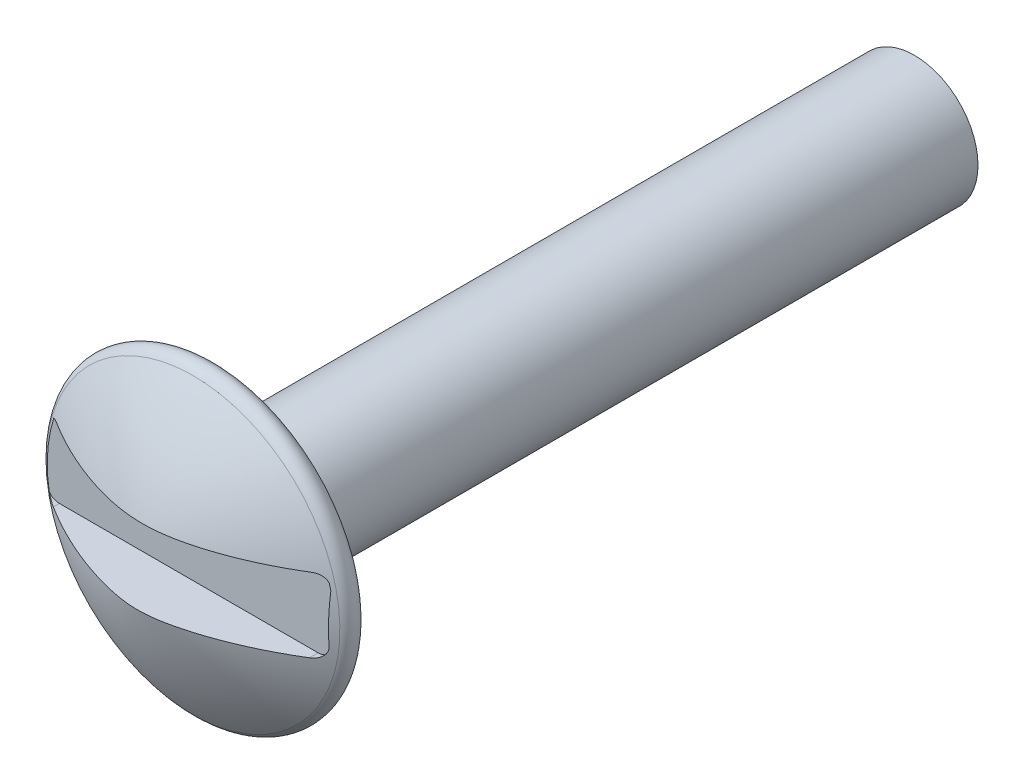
from build123d import *

# Parameters (mm, degrees)
SKETCH1_R           = 5
BOSS_EXTRUDE1_DEPTH = 55
CUT_EXTRUDE1_DEPTH  = 23


with BuildPart() as part:
    # Sketch1 → Boss-Extrude1 (new body)
    with BuildSketch(Plane.XY):
        Circle(SKETCH1_R)
    extrude(amount=BOSS_EXTRUDE1_DEPTH)

    # Sketch2 → Revolve1 (revolve)
    with BuildSketch(Plane(origin=(0, 0, 0), x_dir=(0, 0, -1), z_dir=(1, 0, 0)), mode=Mode.PRIVATE) as revolve1_sk:
        with BuildLine():
            Line((-55, 0), (-55, 10.990159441))
            ThreePointArc((-55, 10.990159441), (-55.698999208, 11.943783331), (-56.818797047, 11.564242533))
            add(Edge.make_bspline(
                [(-61.689517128, 0), (-60.903524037, 4.183001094), (-59.263145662, 8.077943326), (-56.818797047, 11.564242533)],
                knots=[0, 0, 0, 0, 0.812856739, 0.812856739, 0.812856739, 0.812856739], degree=3))
            Line((-61.689517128, 0), (-55, 0))
        make_face()
    revolve(revolve1_sk.sketch.rotate(Axis((0, 0, 49.75333533), (0, 0, 1)), 90), axis=Axis((0, 0, 49.75333533), (0, 0, 1)))

    # Sketch3 → Cut-Extrude1 (cut)
    with BuildSketch(Plane.XY.offset(80)):
        with BuildLine():
            Line((10.030295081, 3.473369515), (-10.34502777, 3.473369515))
            ThreePointArc((-10.34502777, 3.473369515), (-11.052134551, 3.180476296), (-11.34502777, 2.473369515))
            Line((-11.34502777, 2.473369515), (-11.34502777, -1.24099314))
            ThreePointArc((-11.34502777, -1.24099314), (-11.052134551, -1.948099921), (-10.34502777, -2.24099314))
            Line((-10.34502777, -2.24099314), (10.030295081, -2.24099314))
            ThreePointArc((10.030295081, -2.24099314), (10.737401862, -1.948099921), (11.030295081, -1.24099314))
            Line((11.030295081, -1.24099314), (11.030295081, 2.473369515))
            ThreePointArc((11.030295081, 2.473369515), (10.737401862, 3.180476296), (10.030295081, 3.473369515))
        make_face()
    extrude(amount=-CUT_EXTRUDE1_DEPTH, mode=Mode.SUBTRACT)


solid = part.part
